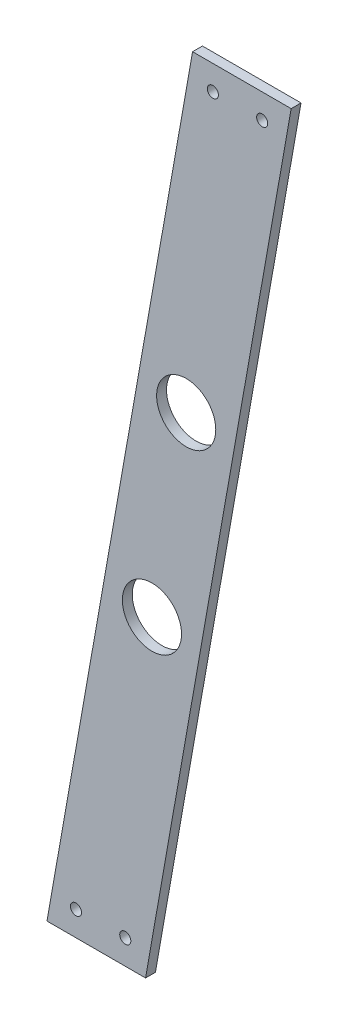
ISO-10303-21;
HEADER;
FILE_DESCRIPTION(('STEP AP214'),'2;1');
FILE_NAME('part.step','',(''),(''),'','','');
FILE_SCHEMA(('AUTOMOTIVE_DESIGN { 1 0 10303 214 1 1 1 1 }'));
ENDSEC;
DATA;
#1=APPLICATION_CONTEXT('core data for automotive mechanical design processes');
#2=APPLICATION_PROTOCOL_DEFINITION('international standard','automotive_design',2000,#1);
#3=PRODUCT_CONTEXT('',#1,'mechanical');
#4=PRODUCT('Part','Part','',(#3));
#5=PRODUCT_RELATED_PRODUCT_CATEGORY('part','',(#4));
#6=PRODUCT_DEFINITION_FORMATION('','',#4);
#7=PRODUCT_DEFINITION_CONTEXT('part definition',#1,'design');
#8=PRODUCT_DEFINITION('design','',#6,#7);
#9=PRODUCT_DEFINITION_SHAPE('','',#8);
#10=(LENGTH_UNIT() NAMED_UNIT(*) SI_UNIT(.MILLI.,.METRE.));
#11=(NAMED_UNIT(*) PLANE_ANGLE_UNIT() SI_UNIT($,.RADIAN.));
#12=(NAMED_UNIT(*) SI_UNIT($,.STERADIAN.) SOLID_ANGLE_UNIT());
#13=UNCERTAINTY_MEASURE_WITH_UNIT(LENGTH_MEASURE(1.E-05),#10,'distance_accuracy_value','');
#14=(GEOMETRIC_REPRESENTATION_CONTEXT(3) GLOBAL_UNCERTAINTY_ASSIGNED_CONTEXT((#13)) GLOBAL_UNIT_ASSIGNED_CONTEXT((#10,
#11,#12)) REPRESENTATION_CONTEXT('',''));
#15=CARTESIAN_POINT('',(0.,0.,0.));
#16=DIRECTION('',(0.,0.,1.));
#17=DIRECTION('',(1.,0.,0.));
#18=AXIS2_PLACEMENT_3D('',#15,#16,#17);
#19=CARTESIAN_POINT('',(0.,0.,4.));
#20=DIRECTION('',(0.,0.,-1.));
#21=DIRECTION('',(-1.,0.,0.));
#22=AXIS2_PLACEMENT_3D('',#19,#20,#21);
#23=PLANE('',#22);
#24=CARTESIAN_POINT('',(8.23673019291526,-10.,4.));
#25=DIRECTION('',(0.,0.,1.));
#26=DIRECTION('',(1.,0.,0.));
#27=AXIS2_PLACEMENT_3D('',#24,#25,#26);
#28=CIRCLE('',#27,2.25);
#29=CARTESIAN_POINT('',(10.4867301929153,-10.,4.));
#30=VERTEX_POINT('',#29);
#31=EDGE_CURVE('E132',#30,#30,#28,.T.);
#32=ORIENTED_EDGE('',*,*,#31,.F.);
#33=EDGE_LOOP('',(#32));
#34=FACE_BOUND('',#33,.T.);
#35=CARTESIAN_POINT('',(-47.3062687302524,-325.,4.));
#36=DIRECTION('',(0.,0.,1.));
#37=DIRECTION('',(1.,0.,0.));
#38=AXIS2_PLACEMENT_3D('',#35,#36,#37);
#39=CIRCLE('',#38,2.25);
#40=CARTESIAN_POINT('',(-45.0562687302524,-325.,4.));
#41=VERTEX_POINT('',#40);
#42=EDGE_CURVE('E120',#41,#41,#39,.T.);
#43=ORIENTED_EDGE('',*,*,#42,.F.);
#44=EDGE_LOOP('',(#43));
#45=FACE_BOUND('',#44,.T.);
#46=CARTESIAN_POINT('',(-2.58884216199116,-128.107689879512,4.));
#47=DIRECTION('',(0.,0.,1.));
#48=DIRECTION('',(1.,0.,0.));
#49=AXIS2_PLACEMENT_3D('',#46,#47,#48);
#50=CIRCLE('',#49,12.);
#51=CARTESIAN_POINT('',(9.41115783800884,-128.107689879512,4.));
#52=VERTEX_POINT('',#51);
#53=EDGE_CURVE('E99',#52,#52,#50,.T.);
#54=ORIENTED_EDGE('',*,*,#53,.F.);
#55=EDGE_LOOP('',(#54));
#56=FACE_BOUND('',#55,.T.);
#57=DIRECTION('',(-0.173648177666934,-0.984807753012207,0.));
#58=VECTOR('',#57,1.);
#59=CARTESIAN_POINT('',(-59.0695385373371,-335.,4.));
#60=LINE('',#59,#58);
#61=CARTESIAN_POINT('',(0.,0.,4.));
#62=VERTEX_POINT('',#61);
#63=CARTESIAN_POINT('',(-59.0695385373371,-335.,4.));
#64=VERTEX_POINT('',#63);
#65=EDGE_CURVE('E84',#62,#64,#60,.T.);
#66=ORIENTED_EDGE('',*,*,#65,.T.);
#67=DIRECTION('',(1.,0.,0.));
#68=VECTOR('',#67,1.);
#69=CARTESIAN_POINT('',(-19.069538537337,-335.,4.));
#70=LINE('',#69,#68);
#71=CARTESIAN_POINT('',(-19.069538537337,-335.,4.));
#72=VERTEX_POINT('',#71);
#73=EDGE_CURVE('E79',#64,#72,#70,.T.);
#74=ORIENTED_EDGE('',*,*,#73,.T.);
#75=DIRECTION('',(0.173648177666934,0.984807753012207,0.));
#76=VECTOR('',#75,1.);
#77=CARTESIAN_POINT('',(40.,0.,4.));
#78=LINE('',#77,#76);
#79=CARTESIAN_POINT('',(40.,0.,4.));
#80=VERTEX_POINT('',#79);
#81=EDGE_CURVE('E82',#72,#80,#78,.T.);
#82=ORIENTED_EDGE('',*,*,#81,.T.);
#83=DIRECTION('',(-1.,0.,0.));
#84=VECTOR('',#83,1.);
#85=CARTESIAN_POINT('',(0.,0.,4.));
#86=LINE('',#85,#84);
#87=EDGE_CURVE('E49',#80,#62,#86,.T.);
#88=ORIENTED_EDGE('',*,*,#87,.T.);
#89=EDGE_LOOP('',(#66,#74,#82,#88));
#90=FACE_BOUND('',#89,.T.);
#91=CARTESIAN_POINT('',(-16.4806963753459,-206.892310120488,4.));
#92=DIRECTION('',(0.,0.,1.));
#93=DIRECTION('',(1.,0.,0.));
#94=AXIS2_PLACEMENT_3D('',#91,#92,#93);
#95=CIRCLE('',#94,12.);
#96=CARTESIAN_POINT('',(-4.48069637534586,-206.892310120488,4.));
#97=VERTEX_POINT('',#96);
#98=EDGE_CURVE('E114',#97,#97,#95,.T.);
#99=ORIENTED_EDGE('',*,*,#98,.F.);
#100=EDGE_LOOP('',(#99));
#101=FACE_BOUND('',#100,.T.);
#102=CARTESIAN_POINT('',(28.2367301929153,-10.,4.));
#103=DIRECTION('',(0.,0.,1.));
#104=DIRECTION('',(1.,0.,0.));
#105=AXIS2_PLACEMENT_3D('',#102,#103,#104);
#106=CIRCLE('',#105,2.25);
#107=CARTESIAN_POINT('',(30.4867301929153,-10.,4.));
#108=VERTEX_POINT('',#107);
#109=EDGE_CURVE('E126',#108,#108,#106,.T.);
#110=ORIENTED_EDGE('',*,*,#109,.F.);
#111=EDGE_LOOP('',(#110));
#112=FACE_BOUND('',#111,.T.);
#113=CARTESIAN_POINT('',(-27.3062687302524,-325.,4.));
#114=DIRECTION('',(0.,0.,1.));
#115=DIRECTION('',(1.,0.,0.));
#116=AXIS2_PLACEMENT_3D('',#113,#114,#115);
#117=CIRCLE('',#116,2.25);
#118=CARTESIAN_POINT('',(-25.0562687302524,-325.,4.));
#119=VERTEX_POINT('',#118);
#120=EDGE_CURVE('E138',#119,#119,#117,.T.);
#121=ORIENTED_EDGE('',*,*,#120,.F.);
#122=EDGE_LOOP('',(#121));
#123=FACE_BOUND('',#122,.T.);
#124=ADVANCED_FACE('F32',(#34,#45,#56,#90,#101,#112,#123),#23,.F.);
#125=CARTESIAN_POINT('',(0.,0.,0.));
#126=DIRECTION('',(0.,0.,-1.));
#127=DIRECTION('',(-1.,0.,0.));
#128=AXIS2_PLACEMENT_3D('',#125,#126,#127);
#129=PLANE('',#128);
#130=CARTESIAN_POINT('',(8.23673019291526,-10.,0.));
#131=DIRECTION('',(0.,0.,1.));
#132=DIRECTION('',(1.,0.,0.));
#133=AXIS2_PLACEMENT_3D('',#130,#131,#132);
#134=CIRCLE('',#133,2.25);
#135=CARTESIAN_POINT('',(10.4867301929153,-10.,0.));
#136=VERTEX_POINT('',#135);
#137=EDGE_CURVE('E135',#136,#136,#134,.T.);
#138=ORIENTED_EDGE('',*,*,#137,.T.);
#139=EDGE_LOOP('',(#138));
#140=FACE_BOUND('',#139,.T.);
#141=CARTESIAN_POINT('',(-47.3062687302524,-325.,0.));
#142=DIRECTION('',(0.,0.,1.));
#143=DIRECTION('',(1.,0.,0.));
#144=AXIS2_PLACEMENT_3D('',#141,#142,#143);
#145=CIRCLE('',#144,2.25);
#146=CARTESIAN_POINT('',(-45.0562687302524,-325.,0.));
#147=VERTEX_POINT('',#146);
#148=EDGE_CURVE('E123',#147,#147,#145,.T.);
#149=ORIENTED_EDGE('',*,*,#148,.T.);
#150=EDGE_LOOP('',(#149));
#151=FACE_BOUND('',#150,.T.);
#152=CARTESIAN_POINT('',(-2.58884216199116,-128.107689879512,0.));
#153=DIRECTION('',(0.,0.,1.));
#154=DIRECTION('',(1.,0.,0.));
#155=AXIS2_PLACEMENT_3D('',#152,#153,#154);
#156=CIRCLE('',#155,12.);
#157=CARTESIAN_POINT('',(9.41115783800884,-128.107689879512,0.));
#158=VERTEX_POINT('',#157);
#159=EDGE_CURVE('E111',#158,#158,#156,.T.);
#160=ORIENTED_EDGE('',*,*,#159,.T.);
#161=EDGE_LOOP('',(#160));
#162=FACE_BOUND('',#161,.T.);
#163=DIRECTION('',(-0.173648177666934,-0.984807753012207,0.));
#164=VECTOR('',#163,1.);
#165=CARTESIAN_POINT('',(-59.0695385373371,-335.,0.));
#166=LINE('',#165,#164);
#167=CARTESIAN_POINT('',(0.,0.,0.));
#168=VERTEX_POINT('',#167);
#169=CARTESIAN_POINT('',(-59.0695385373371,-335.,0.));
#170=VERTEX_POINT('',#169);
#171=EDGE_CURVE('E96',#168,#170,#166,.T.);
#172=ORIENTED_EDGE('',*,*,#171,.F.);
#173=DIRECTION('',(-1.,0.,0.));
#174=VECTOR('',#173,1.);
#175=CARTESIAN_POINT('',(0.,0.,0.));
#176=LINE('',#175,#174);
#177=CARTESIAN_POINT('',(40.,0.,0.));
#178=VERTEX_POINT('',#177);
#179=EDGE_CURVE('E72',#178,#168,#176,.T.);
#180=ORIENTED_EDGE('',*,*,#179,.F.);
#181=DIRECTION('',(0.173648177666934,0.984807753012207,0.));
#182=VECTOR('',#181,1.);
#183=CARTESIAN_POINT('',(40.,0.,0.));
#184=LINE('',#183,#182);
#185=CARTESIAN_POINT('',(-19.069538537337,-335.,0.));
#186=VERTEX_POINT('',#185);
#187=EDGE_CURVE('E66',#186,#178,#184,.T.);
#188=ORIENTED_EDGE('',*,*,#187,.F.);
#189=DIRECTION('',(1.,0.,0.));
#190=VECTOR('',#189,1.);
#191=CARTESIAN_POINT('',(-19.069538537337,-335.,0.));
#192=LINE('',#191,#190);
#193=EDGE_CURVE('E88',#170,#186,#192,.T.);
#194=ORIENTED_EDGE('',*,*,#193,.F.);
#195=EDGE_LOOP('',(#172,#180,#188,#194));
#196=FACE_BOUND('',#195,.T.);
#197=CARTESIAN_POINT('',(-16.4806963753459,-206.892310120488,0.));
#198=DIRECTION('',(0.,0.,1.));
#199=DIRECTION('',(1.,0.,0.));
#200=AXIS2_PLACEMENT_3D('',#197,#198,#199);
#201=CIRCLE('',#200,12.);
#202=CARTESIAN_POINT('',(-4.48069637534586,-206.892310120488,0.));
#203=VERTEX_POINT('',#202);
#204=EDGE_CURVE('E117',#203,#203,#201,.T.);
#205=ORIENTED_EDGE('',*,*,#204,.T.);
#206=EDGE_LOOP('',(#205));
#207=FACE_BOUND('',#206,.T.);
#208=CARTESIAN_POINT('',(28.2367301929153,-10.,0.));
#209=DIRECTION('',(0.,0.,1.));
#210=DIRECTION('',(1.,0.,0.));
#211=AXIS2_PLACEMENT_3D('',#208,#209,#210);
#212=CIRCLE('',#211,2.25);
#213=CARTESIAN_POINT('',(30.4867301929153,-10.,0.));
#214=VERTEX_POINT('',#213);
#215=EDGE_CURVE('E129',#214,#214,#212,.T.);
#216=ORIENTED_EDGE('',*,*,#215,.T.);
#217=EDGE_LOOP('',(#216));
#218=FACE_BOUND('',#217,.T.);
#219=CARTESIAN_POINT('',(-27.3062687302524,-325.,0.));
#220=DIRECTION('',(0.,0.,1.));
#221=DIRECTION('',(1.,0.,0.));
#222=AXIS2_PLACEMENT_3D('',#219,#220,#221);
#223=CIRCLE('',#222,2.25);
#224=CARTESIAN_POINT('',(-25.0562687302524,-325.,0.));
#225=VERTEX_POINT('',#224);
#226=EDGE_CURVE('E141',#225,#225,#223,.T.);
#227=ORIENTED_EDGE('',*,*,#226,.T.);
#228=EDGE_LOOP('',(#227));
#229=FACE_BOUND('',#228,.T.);
#230=ADVANCED_FACE('F107',(#140,#151,#162,#196,#207,#218,#229),#129,.T.);
#231=CARTESIAN_POINT('',(-59.0695385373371,-335.,4.));
#232=DIRECTION('',(0.984807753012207,-0.173648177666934,0.));
#233=DIRECTION('',(0.173648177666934,0.984807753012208,0.));
#234=AXIS2_PLACEMENT_3D('',#231,#232,#233);
#235=PLANE('',#234);
#236=ORIENTED_EDGE('',*,*,#171,.T.);
#237=DIRECTION('',(0.,0.,-1.));
#238=VECTOR('',#237,1.);
#239=CARTESIAN_POINT('',(-59.0695385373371,-335.,4.));
#240=LINE('',#239,#238);
#241=EDGE_CURVE('E11',#64,#170,#240,.T.);
#242=ORIENTED_EDGE('',*,*,#241,.F.);
#243=ORIENTED_EDGE('',*,*,#65,.F.);
#244=DIRECTION('',(0.,0.,-1.));
#245=VECTOR('',#244,1.);
#246=CARTESIAN_POINT('',(0.,0.,4.));
#247=LINE('',#246,#245);
#248=EDGE_CURVE('E92',#62,#168,#247,.T.);
#249=ORIENTED_EDGE('',*,*,#248,.T.);
#250=EDGE_LOOP('',(#236,#242,#243,#249));
#251=FACE_BOUND('',#250,.T.);
#252=ADVANCED_FACE('F34',(#251),#235,.F.);
#253=CARTESIAN_POINT('',(-19.069538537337,-335.,4.));
#254=DIRECTION('',(0.,1.,0.));
#255=DIRECTION('',(-1.,0.,0.));
#256=AXIS2_PLACEMENT_3D('',#253,#254,#255);
#257=PLANE('',#256);
#258=ORIENTED_EDGE('',*,*,#193,.T.);
#259=DIRECTION('',(0.,0.,-1.));
#260=VECTOR('',#259,1.);
#261=CARTESIAN_POINT('',(-19.069538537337,-335.,4.));
#262=LINE('',#261,#260);
#263=EDGE_CURVE('E41',#72,#186,#262,.T.);
#264=ORIENTED_EDGE('',*,*,#263,.F.);
#265=ORIENTED_EDGE('',*,*,#73,.F.);
#266=ORIENTED_EDGE('',*,*,#241,.T.);
#267=EDGE_LOOP('',(#258,#264,#265,#266));
#268=FACE_BOUND('',#267,.T.);
#269=ADVANCED_FACE('F87',(#268),#257,.F.);
#270=CARTESIAN_POINT('',(40.,0.,4.));
#271=DIRECTION('',(-0.984807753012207,0.173648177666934,0.));
#272=DIRECTION('',(-0.173648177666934,-0.984807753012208,0.));
#273=AXIS2_PLACEMENT_3D('',#270,#271,#272);
#274=PLANE('',#273);
#275=ORIENTED_EDGE('',*,*,#187,.T.);
#276=DIRECTION('',(0.,0.,-1.));
#277=VECTOR('',#276,1.);
#278=CARTESIAN_POINT('',(40.,0.,4.));
#279=LINE('',#278,#277);
#280=EDGE_CURVE('E89',#80,#178,#279,.T.);
#281=ORIENTED_EDGE('',*,*,#280,.F.);
#282=ORIENTED_EDGE('',*,*,#81,.F.);
#283=ORIENTED_EDGE('',*,*,#263,.T.);
#284=EDGE_LOOP('',(#275,#281,#282,#283));
#285=FACE_BOUND('',#284,.T.);
#286=ADVANCED_FACE('F90',(#285),#274,.F.);
#287=CARTESIAN_POINT('',(0.,0.,4.));
#288=DIRECTION('',(0.,-1.,0.));
#289=DIRECTION('',(0.,0.,-1.));
#290=AXIS2_PLACEMENT_3D('',#287,#288,#289);
#291=PLANE('',#290);
#292=ORIENTED_EDGE('',*,*,#179,.T.);
#293=ORIENTED_EDGE('',*,*,#248,.F.);
#294=ORIENTED_EDGE('',*,*,#87,.F.);
#295=ORIENTED_EDGE('',*,*,#280,.T.);
#296=EDGE_LOOP('',(#292,#293,#294,#295));
#297=FACE_BOUND('',#296,.T.);
#298=ADVANCED_FACE('F104',(#297),#291,.F.);
#299=CARTESIAN_POINT('',(-2.58884216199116,-128.107689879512,4.));
#300=DIRECTION('',(0.,0.,-1.));
#301=DIRECTION('',(-1.,0.,0.));
#302=AXIS2_PLACEMENT_3D('',#299,#300,#301);
#303=CYLINDRICAL_SURFACE('',#302,12.);
#304=ORIENTED_EDGE('',*,*,#53,.T.);
#305=EDGE_LOOP('',(#304));
#306=FACE_BOUND('',#305,.T.);
#307=ORIENTED_EDGE('',*,*,#159,.F.);
#308=EDGE_LOOP('',(#307));
#309=FACE_BOUND('',#308,.T.);
#310=ADVANCED_FACE('F161',(#306,#309),#303,.F.);
#311=CARTESIAN_POINT('',(-16.4806963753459,-206.892310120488,4.));
#312=DIRECTION('',(0.,0.,-1.));
#313=DIRECTION('',(-1.,0.,0.));
#314=AXIS2_PLACEMENT_3D('',#311,#312,#313);
#315=CYLINDRICAL_SURFACE('',#314,12.);
#316=ORIENTED_EDGE('',*,*,#98,.T.);
#317=EDGE_LOOP('',(#316));
#318=FACE_BOUND('',#317,.T.);
#319=ORIENTED_EDGE('',*,*,#204,.F.);
#320=EDGE_LOOP('',(#319));
#321=FACE_BOUND('',#320,.T.);
#322=ADVANCED_FACE('F207',(#318,#321),#315,.F.);
#323=CARTESIAN_POINT('',(-47.3062687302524,-325.,4.));
#324=DIRECTION('',(0.,0.,-1.));
#325=DIRECTION('',(-1.,0.,0.));
#326=AXIS2_PLACEMENT_3D('',#323,#324,#325);
#327=CYLINDRICAL_SURFACE('',#326,2.25);
#328=ORIENTED_EDGE('',*,*,#42,.T.);
#329=EDGE_LOOP('',(#328));
#330=FACE_BOUND('',#329,.T.);
#331=ORIENTED_EDGE('',*,*,#148,.F.);
#332=EDGE_LOOP('',(#331));
#333=FACE_BOUND('',#332,.T.);
#334=ADVANCED_FACE('F215',(#330,#333),#327,.F.);
#335=CARTESIAN_POINT('',(28.2367301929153,-10.,4.));
#336=DIRECTION('',(0.,0.,-1.));
#337=DIRECTION('',(-1.,0.,0.));
#338=AXIS2_PLACEMENT_3D('',#335,#336,#337);
#339=CYLINDRICAL_SURFACE('',#338,2.25);
#340=ORIENTED_EDGE('',*,*,#109,.T.);
#341=EDGE_LOOP('',(#340));
#342=FACE_BOUND('',#341,.T.);
#343=ORIENTED_EDGE('',*,*,#215,.F.);
#344=EDGE_LOOP('',(#343));
#345=FACE_BOUND('',#344,.T.);
#346=ADVANCED_FACE('F223',(#342,#345),#339,.F.);
#347=CARTESIAN_POINT('',(8.23673019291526,-10.,4.));
#348=DIRECTION('',(0.,0.,-1.));
#349=DIRECTION('',(-1.,0.,0.));
#350=AXIS2_PLACEMENT_3D('',#347,#348,#349);
#351=CYLINDRICAL_SURFACE('',#350,2.25);
#352=ORIENTED_EDGE('',*,*,#31,.T.);
#353=EDGE_LOOP('',(#352));
#354=FACE_BOUND('',#353,.T.);
#355=ORIENTED_EDGE('',*,*,#137,.F.);
#356=EDGE_LOOP('',(#355));
#357=FACE_BOUND('',#356,.T.);
#358=ADVANCED_FACE('F232',(#354,#357),#351,.F.);
#359=CARTESIAN_POINT('',(-27.3062687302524,-325.,4.));
#360=DIRECTION('',(0.,0.,-1.));
#361=DIRECTION('',(-1.,0.,0.));
#362=AXIS2_PLACEMENT_3D('',#359,#360,#361);
#363=CYLINDRICAL_SURFACE('',#362,2.25);
#364=ORIENTED_EDGE('',*,*,#120,.T.);
#365=EDGE_LOOP('',(#364));
#366=FACE_BOUND('',#365,.T.);
#367=ORIENTED_EDGE('',*,*,#226,.F.);
#368=EDGE_LOOP('',(#367));
#369=FACE_BOUND('',#368,.T.);
#370=ADVANCED_FACE('F147',(#366,#369),#363,.F.);
#371=CLOSED_SHELL('',(#124,#230,#252,#269,#286,#298,#310,#322,#334,#346,#358,#370));
#372=MANIFOLD_SOLID_BREP('B2',#371);
#373=ADVANCED_BREP_SHAPE_REPRESENTATION('',(#18,#372),#14);
#374=SHAPE_DEFINITION_REPRESENTATION(#9,#373);
ENDSEC;
END-ISO-10303-21;
